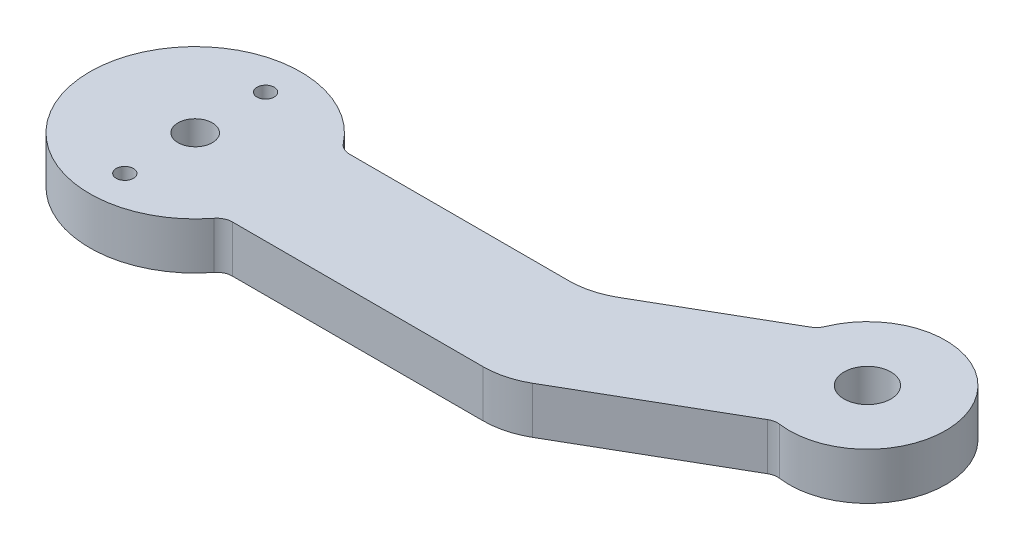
ISO-10303-21;
HEADER;
FILE_DESCRIPTION(('STEP AP214'),'2;1');
FILE_NAME('part.step','',(''),(''),'','','');
FILE_SCHEMA(('AUTOMOTIVE_DESIGN { 1 0 10303 214 1 1 1 1 }'));
ENDSEC;
DATA;
#1=APPLICATION_CONTEXT('core data for automotive mechanical design processes');
#2=APPLICATION_PROTOCOL_DEFINITION('international standard','automotive_design',2000,#1);
#3=PRODUCT_CONTEXT('',#1,'mechanical');
#4=PRODUCT('Part','Part','',(#3));
#5=PRODUCT_RELATED_PRODUCT_CATEGORY('part','',(#4));
#6=PRODUCT_DEFINITION_FORMATION('','',#4);
#7=PRODUCT_DEFINITION_CONTEXT('part definition',#1,'design');
#8=PRODUCT_DEFINITION('design','',#6,#7);
#9=PRODUCT_DEFINITION_SHAPE('','',#8);
#10=(LENGTH_UNIT() NAMED_UNIT(*) SI_UNIT(.MILLI.,.METRE.));
#11=(NAMED_UNIT(*) PLANE_ANGLE_UNIT() SI_UNIT($,.RADIAN.));
#12=(NAMED_UNIT(*) SI_UNIT($,.STERADIAN.) SOLID_ANGLE_UNIT());
#13=UNCERTAINTY_MEASURE_WITH_UNIT(LENGTH_MEASURE(1.E-05),#10,'distance_accuracy_value','');
#14=(GEOMETRIC_REPRESENTATION_CONTEXT(3) GLOBAL_UNCERTAINTY_ASSIGNED_CONTEXT((#13)) GLOBAL_UNIT_ASSIGNED_CONTEXT((#10,
#11,#12)) REPRESENTATION_CONTEXT('',''));
#15=CARTESIAN_POINT('',(0.,0.,0.));
#16=DIRECTION('',(0.,0.,1.));
#17=DIRECTION('',(1.,0.,0.));
#18=AXIS2_PLACEMENT_3D('',#15,#16,#17);
#19=CARTESIAN_POINT('',(40.3108891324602,6.,-17.5000000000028));
#20=DIRECTION('',(0.,-1.,0.));
#21=DIRECTION('',(0.,0.,-1.));
#22=AXIS2_PLACEMENT_3D('',#19,#20,#21);
#23=PLANE('',#22);
#24=CARTESIAN_POINT('',(0.,6.,9.));
#25=DIRECTION('',(0.,1.,0.));
#26=DIRECTION('',(0.,0.,1.));
#27=AXIS2_PLACEMENT_3D('',#24,#25,#26);
#28=CIRCLE('',#27,1.1);
#29=CARTESIAN_POINT('',(0.,6.,10.1));
#30=VERTEX_POINT('',#29);
#31=EDGE_CURVE('E295',#30,#30,#28,.T.);
#32=ORIENTED_EDGE('',*,*,#31,.F.);
#33=EDGE_LOOP('',(#32));
#34=FACE_BOUND('',#33,.T.);
#35=CARTESIAN_POINT('',(0.,6.,0.));
#36=DIRECTION('',(0.,1.,0.));
#37=DIRECTION('',(0.,0.,1.));
#38=AXIS2_PLACEMENT_3D('',#35,#36,#37);
#39=CIRCLE('',#38,2.2);
#40=CARTESIAN_POINT('',(0.,6.,2.2));
#41=VERTEX_POINT('',#40);
#42=EDGE_CURVE('E125',#41,#41,#39,.T.);
#43=ORIENTED_EDGE('',*,*,#42,.F.);
#44=EDGE_LOOP('',(#43));
#45=FACE_BOUND('',#44,.T.);
#46=CARTESIAN_POINT('',(40.3108891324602,6.,-17.5000000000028));
#47=DIRECTION('',(0.,-1.,0.));
#48=DIRECTION('',(0.,0.,-1.));
#49=AXIS2_PLACEMENT_3D('',#46,#47,#48);
#50=CIRCLE('',#49,9.99999999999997);
#51=CARTESIAN_POINT('',(45.3108891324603,6.,-8.83974596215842));
#52=VERTEX_POINT('',#51);
#53=CARTESIAN_POINT('',(40.3108891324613,6.,-7.50000000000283));
#54=VERTEX_POINT('',#53);
#55=EDGE_CURVE('E151',#52,#54,#50,.T.);
#56=ORIENTED_EDGE('',*,*,#55,.T.);
#57=DIRECTION('',(-1.,0.,0.));
#58=VECTOR('',#57,1.);
#59=CARTESIAN_POINT('',(12.247448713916,6.,-7.50000000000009));
#60=LINE('',#59,#58);
#61=CARTESIAN_POINT('',(12.247448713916,6.,-7.5000000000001));
#62=VERTEX_POINT('',#61);
#63=EDGE_CURVE('E120',#54,#62,#60,.T.);
#64=ORIENTED_EDGE('',*,*,#63,.T.);
#65=CARTESIAN_POINT('',(12.2474487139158,6.,-9.5));
#66=DIRECTION('',(0.,-1.,0.));
#67=DIRECTION('',(0.,0.,-1.));
#68=AXIS2_PLACEMENT_3D('',#65,#66,#67);
#69=CIRCLE('',#68,1.9999999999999);
#70=CARTESIAN_POINT('',(10.6671327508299,6.,-8.27419354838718));
#71=VERTEX_POINT('',#70);
#72=EDGE_CURVE('E154',#62,#71,#69,.T.);
#73=ORIENTED_EDGE('',*,*,#72,.T.);
#74=CARTESIAN_POINT('',(0.,6.,0.));
#75=DIRECTION('',(0.,1.,0.));
#76=DIRECTION('',(0.,0.,1.));
#77=AXIS2_PLACEMENT_3D('',#74,#75,#76);
#78=CIRCLE('',#77,13.5);
#79=CARTESIAN_POINT('',(10.6671327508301,6.,8.27419354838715));
#80=VERTEX_POINT('',#79);
#81=EDGE_CURVE('E156',#71,#80,#78,.T.);
#82=ORIENTED_EDGE('',*,*,#81,.T.);
#83=CARTESIAN_POINT('',(12.2474487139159,6.,9.49999999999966));
#84=DIRECTION('',(0.,-1.,0.));
#85=DIRECTION('',(0.,0.,1.));
#86=AXIS2_PLACEMENT_3D('',#83,#84,#85);
#87=CIRCLE('',#86,1.99999999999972);
#88=CARTESIAN_POINT('',(12.2474487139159,6.,7.50000000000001));
#89=VERTEX_POINT('',#88);
#90=EDGE_CURVE('E158',#80,#89,#87,.T.);
#91=ORIENTED_EDGE('',*,*,#90,.T.);
#92=DIRECTION('',(1.,0.,0.));
#93=VECTOR('',#92,1.);
#94=CARTESIAN_POINT('',(12.2474487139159,6.,7.50000000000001));
#95=LINE('',#94,#93);
#96=CARTESIAN_POINT('',(44.330127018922,6.,7.50000000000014));
#97=VERTEX_POINT('',#96);
#98=EDGE_CURVE('E160',#89,#97,#95,.T.);
#99=ORIENTED_EDGE('',*,*,#98,.T.);
#100=CARTESIAN_POINT('',(44.3301270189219,6.,-2.49999999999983));
#101=DIRECTION('',(0.,1.,0.));
#102=DIRECTION('',(0.,0.,-1.));
#103=AXIS2_PLACEMENT_3D('',#100,#101,#102);
#104=CIRCLE('',#103,9.99999999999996);
#105=CARTESIAN_POINT('',(49.3301270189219,6.,6.16025403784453));
#106=VERTEX_POINT('',#105);
#107=EDGE_CURVE('E162',#97,#106,#104,.T.);
#108=ORIENTED_EDGE('',*,*,#107,.T.);
#109=DIRECTION('',(0.866025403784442,0.,-0.499999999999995));
#110=VECTOR('',#109,1.);
#111=CARTESIAN_POINT('',(49.3301270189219,6.,6.16025403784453));
#112=LINE('',#111,#110);
#113=CARTESIAN_POINT('',(68.3815495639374,6.,-4.83908989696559));
#114=VERTEX_POINT('',#113);
#115=EDGE_CURVE('E164',#106,#114,#112,.T.);
#116=ORIENTED_EDGE('',*,*,#115,.T.);
#117=CARTESIAN_POINT('',(69.3815495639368,6.,-3.10703908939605));
#118=DIRECTION('',(0.,-1.,0.));
#119=DIRECTION('',(0.,0.,-1.));
#120=AXIS2_PLACEMENT_3D('',#117,#118,#119);
#121=CIRCLE('',#120,2.00000000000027);
#122=CARTESIAN_POINT('',(69.6480849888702,6.,-5.08919924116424));
#123=VERTEX_POINT('',#122);
#124=EDGE_CURVE('E166',#114,#123,#121,.T.);
#125=ORIENTED_EDGE('',*,*,#124,.T.);
#126=CARTESIAN_POINT('',(70.9807621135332,6.,-14.9999999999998));
#127=DIRECTION('',(0.,1.,0.));
#128=DIRECTION('',(0.,0.,1.));
#129=AXIS2_PLACEMENT_3D('',#126,#127,#128);
#130=CIRCLE('',#129,9.99999999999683);
#131=CARTESIAN_POINT('',(61.7314183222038,6.,-18.8012681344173));
#132=VERTEX_POINT('',#131);
#133=EDGE_CURVE('E168',#123,#132,#130,.T.);
#134=ORIENTED_EDGE('',*,*,#133,.T.);
#135=CARTESIAN_POINT('',(59.8815495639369,6.,-19.5615217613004));
#136=DIRECTION('',(0.,-1.,0.));
#137=DIRECTION('',(0.,0.,1.));
#138=AXIS2_PLACEMENT_3D('',#135,#136,#137);
#139=CIRCLE('',#138,2.00000000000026);
#140=CARTESIAN_POINT('',(60.8815495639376,6.,-17.829470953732));
#141=VERTEX_POINT('',#140);
#142=EDGE_CURVE('E37',#132,#141,#139,.T.);
#143=ORIENTED_EDGE('',*,*,#142,.T.);
#144=DIRECTION('',(-0.866025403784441,0.,0.499999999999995));
#145=VECTOR('',#144,1.);
#146=CARTESIAN_POINT('',(45.3108891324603,6.,-8.83974596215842));
#147=LINE('',#146,#145);
#148=EDGE_CURVE('E32',#141,#52,#147,.T.);
#149=ORIENTED_EDGE('',*,*,#148,.T.);
#150=EDGE_LOOP('',(#56,#64,#73,#82,#91,#99,#108,#116,#125,#134,#143,#149));
#151=FACE_BOUND('',#150,.T.);
#152=CARTESIAN_POINT('',(0.,6.,-9.));
#153=DIRECTION('',(0.,1.,0.));
#154=DIRECTION('',(0.,0.,1.));
#155=AXIS2_PLACEMENT_3D('',#152,#153,#154);
#156=CIRCLE('',#155,1.1);
#157=CARTESIAN_POINT('',(0.,6.,-7.9));
#158=VERTEX_POINT('',#157);
#159=EDGE_CURVE('E301',#158,#158,#156,.T.);
#160=ORIENTED_EDGE('',*,*,#159,.F.);
#161=EDGE_LOOP('',(#160));
#162=FACE_BOUND('',#161,.T.);
#163=CARTESIAN_POINT('',(70.9807621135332,6.,-14.9999999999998));
#164=DIRECTION('',(0.,1.,0.));
#165=DIRECTION('',(0.,0.,1.));
#166=AXIS2_PLACEMENT_3D('',#163,#164,#165);
#167=CIRCLE('',#166,3.00000000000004);
#168=CARTESIAN_POINT('',(70.9807621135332,6.,-11.9999999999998));
#169=VERTEX_POINT('',#168);
#170=EDGE_CURVE('E284',#169,#169,#167,.T.);
#171=ORIENTED_EDGE('',*,*,#170,.F.);
#172=EDGE_LOOP('',(#171));
#173=FACE_BOUND('',#172,.T.);
#174=ADVANCED_FACE('F17',(#34,#45,#151,#162,#173),#23,.F.);
#175=CARTESIAN_POINT('',(40.3108891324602,0.,-17.5000000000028));
#176=DIRECTION('',(0.,-1.,0.));
#177=DIRECTION('',(0.,0.,-1.));
#178=AXIS2_PLACEMENT_3D('',#175,#176,#177);
#179=PLANE('',#178);
#180=CARTESIAN_POINT('',(0.,0.,9.));
#181=DIRECTION('',(0.,1.,0.));
#182=DIRECTION('',(0.,0.,1.));
#183=AXIS2_PLACEMENT_3D('',#180,#181,#182);
#184=CIRCLE('',#183,1.1);
#185=CARTESIAN_POINT('',(0.,0.,10.1));
#186=VERTEX_POINT('',#185);
#187=EDGE_CURVE('E290',#186,#186,#184,.T.);
#188=ORIENTED_EDGE('',*,*,#187,.T.);
#189=EDGE_LOOP('',(#188));
#190=FACE_BOUND('',#189,.T.);
#191=CARTESIAN_POINT('',(0.,0.,0.));
#192=DIRECTION('',(0.,1.,0.));
#193=DIRECTION('',(0.,0.,1.));
#194=AXIS2_PLACEMENT_3D('',#191,#192,#193);
#195=CIRCLE('',#194,2.2);
#196=CARTESIAN_POINT('',(0.,0.,2.2));
#197=VERTEX_POINT('',#196);
#198=EDGE_CURVE('E128',#197,#197,#195,.T.);
#199=ORIENTED_EDGE('',*,*,#198,.T.);
#200=EDGE_LOOP('',(#199));
#201=FACE_BOUND('',#200,.T.);
#202=CARTESIAN_POINT('',(40.3108891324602,0.,-17.5000000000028));
#203=DIRECTION('',(0.,-1.,0.));
#204=DIRECTION('',(0.,0.,-1.));
#205=AXIS2_PLACEMENT_3D('',#202,#203,#204);
#206=CIRCLE('',#205,9.99999999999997);
#207=CARTESIAN_POINT('',(45.3108891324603,0.,-8.83974596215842));
#208=VERTEX_POINT('',#207);
#209=CARTESIAN_POINT('',(40.3108891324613,0.,-7.50000000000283));
#210=VERTEX_POINT('',#209);
#211=EDGE_CURVE('E111',#208,#210,#206,.T.);
#212=ORIENTED_EDGE('',*,*,#211,.F.);
#213=DIRECTION('',(-0.866025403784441,0.,0.499999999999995));
#214=VECTOR('',#213,1.);
#215=CARTESIAN_POINT('',(45.3108891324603,0.,-8.83974596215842));
#216=LINE('',#215,#214);
#217=CARTESIAN_POINT('',(60.8815495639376,0.,-17.829470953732));
#218=VERTEX_POINT('',#217);
#219=EDGE_CURVE('E149',#218,#208,#216,.T.);
#220=ORIENTED_EDGE('',*,*,#219,.F.);
#221=CARTESIAN_POINT('',(59.8815495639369,0.,-19.5615217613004));
#222=DIRECTION('',(0.,-1.,0.));
#223=DIRECTION('',(0.,0.,1.));
#224=AXIS2_PLACEMENT_3D('',#221,#222,#223);
#225=CIRCLE('',#224,2.00000000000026);
#226=CARTESIAN_POINT('',(61.7314183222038,0.,-18.8012681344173));
#227=VERTEX_POINT('',#226);
#228=EDGE_CURVE('E147',#227,#218,#225,.T.);
#229=ORIENTED_EDGE('',*,*,#228,.F.);
#230=CARTESIAN_POINT('',(70.9807621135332,0.,-14.9999999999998));
#231=DIRECTION('',(0.,1.,0.));
#232=DIRECTION('',(0.,0.,1.));
#233=AXIS2_PLACEMENT_3D('',#230,#231,#232);
#234=CIRCLE('',#233,9.99999999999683);
#235=CARTESIAN_POINT('',(69.6480849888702,0.,-5.08919924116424));
#236=VERTEX_POINT('',#235);
#237=EDGE_CURVE('E145',#236,#227,#234,.T.);
#238=ORIENTED_EDGE('',*,*,#237,.F.);
#239=CARTESIAN_POINT('',(69.3815495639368,0.,-3.10703908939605));
#240=DIRECTION('',(0.,-1.,0.));
#241=DIRECTION('',(0.,0.,-1.));
#242=AXIS2_PLACEMENT_3D('',#239,#240,#241);
#243=CIRCLE('',#242,2.00000000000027);
#244=CARTESIAN_POINT('',(68.3815495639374,0.,-4.83908989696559));
#245=VERTEX_POINT('',#244);
#246=EDGE_CURVE('E143',#245,#236,#243,.T.);
#247=ORIENTED_EDGE('',*,*,#246,.F.);
#248=DIRECTION('',(0.866025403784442,0.,-0.499999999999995));
#249=VECTOR('',#248,1.);
#250=CARTESIAN_POINT('',(49.3301270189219,0.,6.16025403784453));
#251=LINE('',#250,#249);
#252=CARTESIAN_POINT('',(49.3301270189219,0.,6.16025403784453));
#253=VERTEX_POINT('',#252);
#254=EDGE_CURVE('E141',#253,#245,#251,.T.);
#255=ORIENTED_EDGE('',*,*,#254,.F.);
#256=CARTESIAN_POINT('',(44.3301270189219,0.,-2.49999999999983));
#257=DIRECTION('',(0.,1.,0.));
#258=DIRECTION('',(0.,0.,-1.));
#259=AXIS2_PLACEMENT_3D('',#256,#257,#258);
#260=CIRCLE('',#259,9.99999999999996);
#261=CARTESIAN_POINT('',(44.330127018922,0.,7.50000000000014));
#262=VERTEX_POINT('',#261);
#263=EDGE_CURVE('E139',#262,#253,#260,.T.);
#264=ORIENTED_EDGE('',*,*,#263,.F.);
#265=DIRECTION('',(1.,0.,0.));
#266=VECTOR('',#265,1.);
#267=CARTESIAN_POINT('',(12.2474487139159,0.,7.50000000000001));
#268=LINE('',#267,#266);
#269=CARTESIAN_POINT('',(12.2474487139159,0.,7.50000000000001));
#270=VERTEX_POINT('',#269);
#271=EDGE_CURVE('E137',#270,#262,#268,.T.);
#272=ORIENTED_EDGE('',*,*,#271,.F.);
#273=CARTESIAN_POINT('',(12.2474487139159,0.,9.49999999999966));
#274=DIRECTION('',(0.,-1.,0.));
#275=DIRECTION('',(0.,0.,1.));
#276=AXIS2_PLACEMENT_3D('',#273,#274,#275);
#277=CIRCLE('',#276,1.99999999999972);
#278=CARTESIAN_POINT('',(10.6671327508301,0.,8.27419354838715));
#279=VERTEX_POINT('',#278);
#280=EDGE_CURVE('E135',#279,#270,#277,.T.);
#281=ORIENTED_EDGE('',*,*,#280,.F.);
#282=CARTESIAN_POINT('',(0.,0.,0.));
#283=DIRECTION('',(0.,1.,0.));
#284=DIRECTION('',(0.,0.,1.));
#285=AXIS2_PLACEMENT_3D('',#282,#283,#284);
#286=CIRCLE('',#285,13.5);
#287=CARTESIAN_POINT('',(10.6671327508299,0.,-8.27419354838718));
#288=VERTEX_POINT('',#287);
#289=EDGE_CURVE('E133',#288,#279,#286,.T.);
#290=ORIENTED_EDGE('',*,*,#289,.F.);
#291=CARTESIAN_POINT('',(12.2474487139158,0.,-9.5));
#292=DIRECTION('',(0.,-1.,0.));
#293=DIRECTION('',(0.,0.,-1.));
#294=AXIS2_PLACEMENT_3D('',#291,#292,#293);
#295=CIRCLE('',#294,1.9999999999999);
#296=CARTESIAN_POINT('',(12.247448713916,0.,-7.5000000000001));
#297=VERTEX_POINT('',#296);
#298=EDGE_CURVE('E113',#297,#288,#295,.T.);
#299=ORIENTED_EDGE('',*,*,#298,.F.);
#300=DIRECTION('',(-1.,0.,0.));
#301=VECTOR('',#300,1.);
#302=CARTESIAN_POINT('',(12.247448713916,0.,-7.50000000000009));
#303=LINE('',#302,#301);
#304=EDGE_CURVE('E106',#210,#297,#303,.T.);
#305=ORIENTED_EDGE('',*,*,#304,.F.);
#306=EDGE_LOOP('',(#212,#220,#229,#238,#247,#255,#264,#272,#281,#290,#299,#305));
#307=FACE_BOUND('',#306,.T.);
#308=CARTESIAN_POINT('',(0.,0.,-9.));
#309=DIRECTION('',(0.,1.,0.));
#310=DIRECTION('',(0.,0.,1.));
#311=AXIS2_PLACEMENT_3D('',#308,#309,#310);
#312=CIRCLE('',#311,1.1);
#313=CARTESIAN_POINT('',(0.,0.,-7.9));
#314=VERTEX_POINT('',#313);
#315=EDGE_CURVE('E298',#314,#314,#312,.T.);
#316=ORIENTED_EDGE('',*,*,#315,.T.);
#317=EDGE_LOOP('',(#316));
#318=FACE_BOUND('',#317,.T.);
#319=CARTESIAN_POINT('',(70.9807621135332,0.,-14.9999999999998));
#320=DIRECTION('',(0.,1.,0.));
#321=DIRECTION('',(0.,0.,1.));
#322=AXIS2_PLACEMENT_3D('',#319,#320,#321);
#323=CIRCLE('',#322,3.00000000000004);
#324=CARTESIAN_POINT('',(70.9807621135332,0.,-11.9999999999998));
#325=VERTEX_POINT('',#324);
#326=EDGE_CURVE('E287',#325,#325,#323,.T.);
#327=ORIENTED_EDGE('',*,*,#326,.T.);
#328=EDGE_LOOP('',(#327));
#329=FACE_BOUND('',#328,.T.);
#330=ADVANCED_FACE('F107',(#190,#201,#307,#318,#329),#179,.T.);
#331=CARTESIAN_POINT('',(40.3108891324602,6.,-17.5000000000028));
#332=DIRECTION('',(0.,-1.,0.));
#333=DIRECTION('',(0.,0.,-1.));
#334=AXIS2_PLACEMENT_3D('',#331,#332,#333);
#335=CYLINDRICAL_SURFACE('',#334,9.99999999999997);
#336=ORIENTED_EDGE('',*,*,#211,.T.);
#337=DIRECTION('',(0.,-1.,0.));
#338=VECTOR('',#337,1.);
#339=CARTESIAN_POINT('',(40.3108891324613,6.,-7.50000000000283));
#340=LINE('',#339,#338);
#341=EDGE_CURVE('E11',#54,#210,#340,.T.);
#342=ORIENTED_EDGE('',*,*,#341,.F.);
#343=ORIENTED_EDGE('',*,*,#55,.F.);
#344=DIRECTION('',(0.,-1.,0.));
#345=VECTOR('',#344,1.);
#346=CARTESIAN_POINT('',(45.3108891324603,6.,-8.83974596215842));
#347=LINE('',#346,#345);
#348=EDGE_CURVE('E124',#52,#208,#347,.T.);
#349=ORIENTED_EDGE('',*,*,#348,.T.);
#350=EDGE_LOOP('',(#336,#342,#343,#349));
#351=FACE_BOUND('',#350,.T.);
#352=ADVANCED_FACE('F19',(#351),#335,.F.);
#353=CARTESIAN_POINT('',(12.247448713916,6.,-7.50000000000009));
#354=DIRECTION('',(0.,0.,1.));
#355=DIRECTION('',(1.,0.,0.));
#356=AXIS2_PLACEMENT_3D('',#353,#354,#355);
#357=PLANE('',#356);
#358=ORIENTED_EDGE('',*,*,#304,.T.);
#359=DIRECTION('',(0.,-1.,0.));
#360=VECTOR('',#359,1.);
#361=CARTESIAN_POINT('',(12.247448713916,6.,-7.5000000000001));
#362=LINE('',#361,#360);
#363=EDGE_CURVE('E25',#62,#297,#362,.T.);
#364=ORIENTED_EDGE('',*,*,#363,.F.);
#365=ORIENTED_EDGE('',*,*,#63,.F.);
#366=ORIENTED_EDGE('',*,*,#341,.T.);
#367=EDGE_LOOP('',(#358,#364,#365,#366));
#368=FACE_BOUND('',#367,.T.);
#369=ADVANCED_FACE('F119',(#368),#357,.F.);
#370=CARTESIAN_POINT('',(12.2474487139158,6.,-9.5));
#371=DIRECTION('',(0.,-1.,0.));
#372=DIRECTION('',(0.,0.,-1.));
#373=AXIS2_PLACEMENT_3D('',#370,#371,#372);
#374=CYLINDRICAL_SURFACE('',#373,1.9999999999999);
#375=ORIENTED_EDGE('',*,*,#298,.T.);
#376=DIRECTION('',(0.,-1.,0.));
#377=VECTOR('',#376,1.);
#378=CARTESIAN_POINT('',(10.6671327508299,6.,-8.27419354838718));
#379=LINE('',#378,#377);
#380=EDGE_CURVE('E197',#71,#288,#379,.T.);
#381=ORIENTED_EDGE('',*,*,#380,.F.);
#382=ORIENTED_EDGE('',*,*,#72,.F.);
#383=ORIENTED_EDGE('',*,*,#363,.T.);
#384=EDGE_LOOP('',(#375,#381,#382,#383));
#385=FACE_BOUND('',#384,.T.);
#386=ADVANCED_FACE('F201',(#385),#374,.F.);
#387=CARTESIAN_POINT('',(0.,6.,0.));
#388=DIRECTION('',(0.,-1.,0.));
#389=DIRECTION('',(0.,0.,-1.));
#390=AXIS2_PLACEMENT_3D('',#387,#388,#389);
#391=CYLINDRICAL_SURFACE('',#390,13.5);
#392=ORIENTED_EDGE('',*,*,#289,.T.);
#393=DIRECTION('',(0.,-1.,0.));
#394=VECTOR('',#393,1.);
#395=CARTESIAN_POINT('',(10.6671327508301,6.,8.27419354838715));
#396=LINE('',#395,#394);
#397=EDGE_CURVE('E194',#80,#279,#396,.T.);
#398=ORIENTED_EDGE('',*,*,#397,.F.);
#399=ORIENTED_EDGE('',*,*,#81,.F.);
#400=ORIENTED_EDGE('',*,*,#380,.T.);
#401=EDGE_LOOP('',(#392,#398,#399,#400));
#402=FACE_BOUND('',#401,.T.);
#403=ADVANCED_FACE('F209',(#402),#391,.T.);
#404=CARTESIAN_POINT('',(12.2474487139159,6.,9.49999999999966));
#405=DIRECTION('',(0.,-1.,0.));
#406=DIRECTION('',(0.,0.,-1.));
#407=AXIS2_PLACEMENT_3D('',#404,#405,#406);
#408=CYLINDRICAL_SURFACE('',#407,1.99999999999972);
#409=ORIENTED_EDGE('',*,*,#280,.T.);
#410=DIRECTION('',(0.,-1.,0.));
#411=VECTOR('',#410,1.);
#412=CARTESIAN_POINT('',(12.2474487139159,6.,7.50000000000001));
#413=LINE('',#412,#411);
#414=EDGE_CURVE('E191',#89,#270,#413,.T.);
#415=ORIENTED_EDGE('',*,*,#414,.F.);
#416=ORIENTED_EDGE('',*,*,#90,.F.);
#417=ORIENTED_EDGE('',*,*,#397,.T.);
#418=EDGE_LOOP('',(#409,#415,#416,#417));
#419=FACE_BOUND('',#418,.T.);
#420=ADVANCED_FACE('F212',(#419),#408,.F.);
#421=CARTESIAN_POINT('',(12.2474487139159,6.,7.50000000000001));
#422=DIRECTION('',(0.,0.,-1.));
#423=DIRECTION('',(-1.,0.,0.));
#424=AXIS2_PLACEMENT_3D('',#421,#422,#423);
#425=PLANE('',#424);
#426=ORIENTED_EDGE('',*,*,#271,.T.);
#427=DIRECTION('',(0.,-1.,0.));
#428=VECTOR('',#427,1.);
#429=CARTESIAN_POINT('',(44.330127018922,6.,7.50000000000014));
#430=LINE('',#429,#428);
#431=EDGE_CURVE('E188',#97,#262,#430,.T.);
#432=ORIENTED_EDGE('',*,*,#431,.F.);
#433=ORIENTED_EDGE('',*,*,#98,.F.);
#434=ORIENTED_EDGE('',*,*,#414,.T.);
#435=EDGE_LOOP('',(#426,#432,#433,#434));
#436=FACE_BOUND('',#435,.T.);
#437=ADVANCED_FACE('F217',(#436),#425,.F.);
#438=CARTESIAN_POINT('',(44.3301270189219,6.,-2.49999999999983));
#439=DIRECTION('',(0.,-1.,0.));
#440=DIRECTION('',(0.,0.,-1.));
#441=AXIS2_PLACEMENT_3D('',#438,#439,#440);
#442=CYLINDRICAL_SURFACE('',#441,9.99999999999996);
#443=ORIENTED_EDGE('',*,*,#263,.T.);
#444=DIRECTION('',(0.,-1.,0.));
#445=VECTOR('',#444,1.);
#446=CARTESIAN_POINT('',(49.3301270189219,6.,6.16025403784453));
#447=LINE('',#446,#445);
#448=EDGE_CURVE('E185',#106,#253,#447,.T.);
#449=ORIENTED_EDGE('',*,*,#448,.F.);
#450=ORIENTED_EDGE('',*,*,#107,.F.);
#451=ORIENTED_EDGE('',*,*,#431,.T.);
#452=EDGE_LOOP('',(#443,#449,#450,#451));
#453=FACE_BOUND('',#452,.T.);
#454=ADVANCED_FACE('F223',(#453),#442,.T.);
#455=CARTESIAN_POINT('',(49.3301270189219,6.,6.16025403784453));
#456=DIRECTION('',(-0.499999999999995,0.,-0.866025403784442));
#457=DIRECTION('',(-0.866025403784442,0.,0.499999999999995));
#458=AXIS2_PLACEMENT_3D('',#455,#456,#457);
#459=PLANE('',#458);
#460=ORIENTED_EDGE('',*,*,#254,.T.);
#461=DIRECTION('',(0.,-1.,0.));
#462=VECTOR('',#461,1.);
#463=CARTESIAN_POINT('',(68.3815495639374,6.,-4.83908989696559));
#464=LINE('',#463,#462);
#465=EDGE_CURVE('E182',#114,#245,#464,.T.);
#466=ORIENTED_EDGE('',*,*,#465,.F.);
#467=ORIENTED_EDGE('',*,*,#115,.F.);
#468=ORIENTED_EDGE('',*,*,#448,.T.);
#469=EDGE_LOOP('',(#460,#466,#467,#468));
#470=FACE_BOUND('',#469,.T.);
#471=ADVANCED_FACE('F227',(#470),#459,.F.);
#472=CARTESIAN_POINT('',(69.3815495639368,6.,-3.10703908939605));
#473=DIRECTION('',(0.,-1.,0.));
#474=DIRECTION('',(0.,0.,-1.));
#475=AXIS2_PLACEMENT_3D('',#472,#473,#474);
#476=CYLINDRICAL_SURFACE('',#475,2.00000000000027);
#477=ORIENTED_EDGE('',*,*,#246,.T.);
#478=DIRECTION('',(0.,-1.,0.));
#479=VECTOR('',#478,1.);
#480=CARTESIAN_POINT('',(69.6480849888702,6.,-5.08919924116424));
#481=LINE('',#480,#479);
#482=EDGE_CURVE('E179',#123,#236,#481,.T.);
#483=ORIENTED_EDGE('',*,*,#482,.F.);
#484=ORIENTED_EDGE('',*,*,#124,.F.);
#485=ORIENTED_EDGE('',*,*,#465,.T.);
#486=EDGE_LOOP('',(#477,#483,#484,#485));
#487=FACE_BOUND('',#486,.T.);
#488=ADVANCED_FACE('F232',(#487),#476,.F.);
#489=CARTESIAN_POINT('',(70.9807621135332,6.,-14.9999999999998));
#490=DIRECTION('',(0.,-1.,0.));
#491=DIRECTION('',(0.,0.,-1.));
#492=AXIS2_PLACEMENT_3D('',#489,#490,#491);
#493=CYLINDRICAL_SURFACE('',#492,9.99999999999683);
#494=ORIENTED_EDGE('',*,*,#237,.T.);
#495=DIRECTION('',(0.,-1.,0.));
#496=VECTOR('',#495,1.);
#497=CARTESIAN_POINT('',(61.7314183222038,6.,-18.8012681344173));
#498=LINE('',#497,#496);
#499=EDGE_CURVE('E176',#132,#227,#498,.T.);
#500=ORIENTED_EDGE('',*,*,#499,.F.);
#501=ORIENTED_EDGE('',*,*,#133,.F.);
#502=ORIENTED_EDGE('',*,*,#482,.T.);
#503=EDGE_LOOP('',(#494,#500,#501,#502));
#504=FACE_BOUND('',#503,.T.);
#505=ADVANCED_FACE('F236',(#504),#493,.T.);
#506=CARTESIAN_POINT('',(59.8815495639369,6.,-19.5615217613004));
#507=DIRECTION('',(0.,-1.,0.));
#508=DIRECTION('',(0.,0.,-1.));
#509=AXIS2_PLACEMENT_3D('',#506,#507,#508);
#510=CYLINDRICAL_SURFACE('',#509,2.00000000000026);
#511=ORIENTED_EDGE('',*,*,#228,.T.);
#512=DIRECTION('',(0.,-1.,0.));
#513=VECTOR('',#512,1.);
#514=CARTESIAN_POINT('',(60.8815495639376,6.,-17.829470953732));
#515=LINE('',#514,#513);
#516=EDGE_CURVE('E173',#141,#218,#515,.T.);
#517=ORIENTED_EDGE('',*,*,#516,.F.);
#518=ORIENTED_EDGE('',*,*,#142,.F.);
#519=ORIENTED_EDGE('',*,*,#499,.T.);
#520=EDGE_LOOP('',(#511,#517,#518,#519));
#521=FACE_BOUND('',#520,.T.);
#522=ADVANCED_FACE('F240',(#521),#510,.F.);
#523=CARTESIAN_POINT('',(45.3108891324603,6.,-8.83974596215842));
#524=DIRECTION('',(0.499999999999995,0.,0.866025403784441));
#525=DIRECTION('',(0.866025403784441,0.,-0.499999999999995));
#526=AXIS2_PLACEMENT_3D('',#523,#524,#525);
#527=PLANE('',#526);
#528=ORIENTED_EDGE('',*,*,#219,.T.);
#529=ORIENTED_EDGE('',*,*,#348,.F.);
#530=ORIENTED_EDGE('',*,*,#148,.F.);
#531=ORIENTED_EDGE('',*,*,#516,.T.);
#532=EDGE_LOOP('',(#528,#529,#530,#531));
#533=FACE_BOUND('',#532,.T.);
#534=ADVANCED_FACE('F242',(#533),#527,.F.);
#535=CARTESIAN_POINT('',(0.,6.,0.));
#536=DIRECTION('',(0.,-1.,0.));
#537=DIRECTION('',(0.,0.,-1.));
#538=AXIS2_PLACEMENT_3D('',#535,#536,#537);
#539=CYLINDRICAL_SURFACE('',#538,2.2);
#540=ORIENTED_EDGE('',*,*,#42,.T.);
#541=EDGE_LOOP('',(#540));
#542=FACE_BOUND('',#541,.T.);
#543=ORIENTED_EDGE('',*,*,#198,.F.);
#544=EDGE_LOOP('',(#543));
#545=FACE_BOUND('',#544,.T.);
#546=ADVANCED_FACE('F244',(#542,#545),#539,.F.);
#547=CARTESIAN_POINT('',(0.,6.,-9.));
#548=DIRECTION('',(0.,-1.,0.));
#549=DIRECTION('',(0.,0.,-1.));
#550=AXIS2_PLACEMENT_3D('',#547,#548,#549);
#551=CYLINDRICAL_SURFACE('',#550,1.1);
#552=ORIENTED_EDGE('',*,*,#159,.T.);
#553=EDGE_LOOP('',(#552));
#554=FACE_BOUND('',#553,.T.);
#555=ORIENTED_EDGE('',*,*,#315,.F.);
#556=EDGE_LOOP('',(#555));
#557=FACE_BOUND('',#556,.T.);
#558=ADVANCED_FACE('F252',(#554,#557),#551,.F.);
#559=CARTESIAN_POINT('',(0.,6.,9.));
#560=DIRECTION('',(0.,-1.,0.));
#561=DIRECTION('',(0.,0.,-1.));
#562=AXIS2_PLACEMENT_3D('',#559,#560,#561);
#563=CYLINDRICAL_SURFACE('',#562,1.1);
#564=ORIENTED_EDGE('',*,*,#31,.T.);
#565=EDGE_LOOP('',(#564));
#566=FACE_BOUND('',#565,.T.);
#567=ORIENTED_EDGE('',*,*,#187,.F.);
#568=EDGE_LOOP('',(#567));
#569=FACE_BOUND('',#568,.T.);
#570=ADVANCED_FACE('F270',(#566,#569),#563,.F.);
#571=CARTESIAN_POINT('',(70.9807621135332,6.,-14.9999999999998));
#572=DIRECTION('',(0.,-1.,0.));
#573=DIRECTION('',(0.,0.,-1.));
#574=AXIS2_PLACEMENT_3D('',#571,#572,#573);
#575=CYLINDRICAL_SURFACE('',#574,3.00000000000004);
#576=ORIENTED_EDGE('',*,*,#170,.T.);
#577=EDGE_LOOP('',(#576));
#578=FACE_BOUND('',#577,.T.);
#579=ORIENTED_EDGE('',*,*,#326,.F.);
#580=EDGE_LOOP('',(#579));
#581=FACE_BOUND('',#580,.T.);
#582=ADVANCED_FACE('F274',(#578,#581),#575,.F.);
#583=CLOSED_SHELL('',(#174,#330,#352,#369,#386,#403,#420,#437,#454,#471,#488,#505,#522,#534,
#546,#558,#570,#582));
#584=MANIFOLD_SOLID_BREP('B1',#583);
#585=ADVANCED_BREP_SHAPE_REPRESENTATION('',(#18,#584),#14);
#586=SHAPE_DEFINITION_REPRESENTATION(#9,#585);
ENDSEC;
END-ISO-10303-21;
